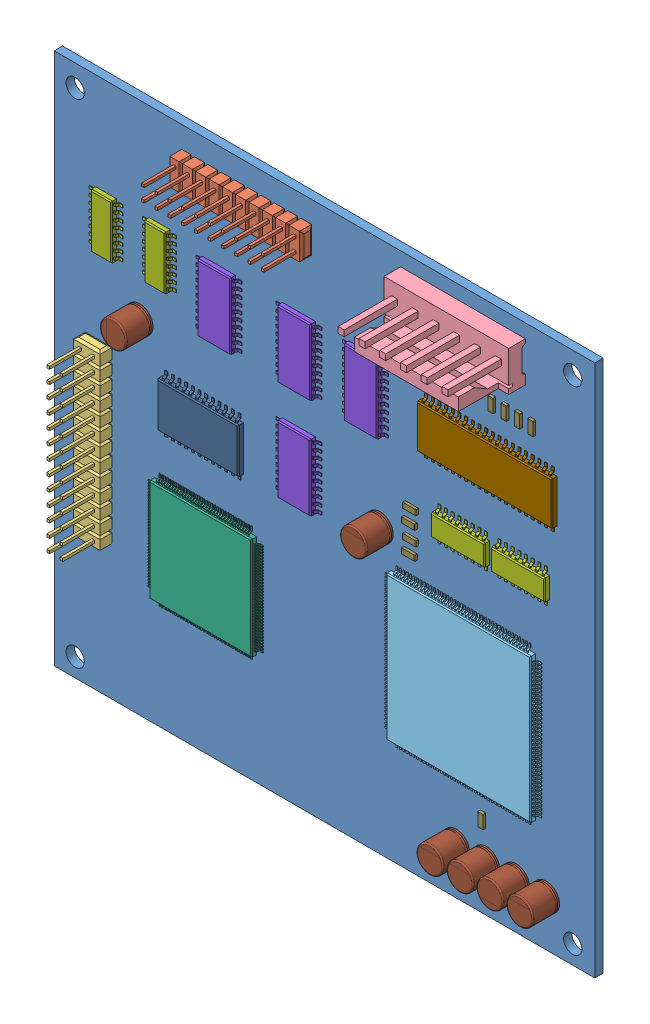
SolidWorks assembly PCB 2.SLDASM, configuration Default (file format 4894). Lengths in mm.
Overall size (103.11 101.6 16.51).
31 component instances, 12 part files, 64 mates.
Components (placement in the parent):
- PCB2-1: PCB2.SLDPRT [Default] at origin size (103.11 101.6 1.6)
- 010897201-1: 010897201.SLDPRT [Default] at (130.7963 94.9293 2.743) x (1 0 0) z (0 -1 0) size (25.4 11.1 5.08)
- 010897261-1: 010897261.SLDPRT [Default] at (102.5733 41.9125 2.743) x (0 1 0) z (1 0 0) size (33.02 11.1 5.08)
- C-0640445-06-3-1: C-0640445-06-3.SLDPRT [Default] at (172.059 95.148 4.775) x (-1 0 0) z (0 0 1) size (23.77 7.62 16.51)
- 160 PIN IC PACKAGE-3: 160 PIN IC PACKAGE.SLDPRT [Default] at (172.1985 33.8975 2.16) x (1 0 0) z (0 -1 0) size (29.9 1.06 29.9)
- 144 PIN IC PACKAGE-4: 144 PIN IC PACKAGE.SLDPRT [Default] at (123.0123 30.7037 2.16) x (1 0 0) z (0 -1 0) size (21.9 1.06 21.9)
- 16 PIN IC PACKAGE-5: 16 PIN IC PACKAGE.SLDPRT [Default] at (114.2542 77.4062 2.16) x (1 0 0) z (0 -1 0) size (6.4 1.06 10.23)
- 16 PIN IC PACKAGE-6: 16 PIN IC PACKAGE.SLDPRT [Default] at (104.0492 77.4062 2.16) x (1 0 0) z (0 -1 0) size (6.4 1.06 10.23)
- 16 PIN IC PACKAGE-7: 16 PIN IC PACKAGE.SLDPRT [Default] at (171.4199 60.231 2.16) x (0 -1 0) z (-1 0 0) size (6.4 1.06 10.23)
- 16 PIN IC PACKAGE-8: 16 PIN IC PACKAGE.SLDPRT [Default] at (182.8729 60.231 2.16) x (0 -1 0) z (-1 0 0) size (6.4 1.06 10.23)
- 20 PIN IC PACKAGE-3: 20 PIN IC PACKAGE.SLDPRT [Default] at (125.5728 74.863 2.16) x (1 0 0) z (0 -1 0) size (8.7 1.06 12.73)
- 20 PIN IC PACKAGE-4: 20 PIN IC PACKAGE.SLDPRT [Default] at (153.5178 76.133 2.16) x (-1 0 0) z (0 1 0) size (8.7 1.06 12.73)
- 20 PIN IC PACKAGE-5: 20 PIN IC PACKAGE.SLDPRT [Default] at (140.8131 55.8084 2.16) x (1 0 0) z (0 -1 0) size (8.7 1.06 12.73)
- 20 PIN IC PACKAGE-6: 20 PIN IC PACKAGE.SLDPRT [Default] at (140.8247 76.133 2.16) x (-1 0 0) z (0 1 0) size (8.7 1.06 12.73)
- 40 PIN IC PACKAGE-2: 40 PIN IC PACKAGE.SLDPRT [Default] at (176.536 75.1992 2.16) x (0 -1 0) z (-1 0 0) size (10.65 1.06 25.73)
- 24 PIN IC PACKAGE-7: 24 PIN IC PACKAGE.SLDPRT [Default] at (123.129 54.0125 2.16) x (0 1 0) z (1 0 0) size (10.9 1.06 15.48)
- CAP-1: CAP.SLDPRT [Default] at (110.3893 65.4238 1.6) x (1 0 0) z (0 -1 0) size (5.08 8.08 5.08)
- CAP-11: CAP.SLDPRT [Default] at (156.2027 53.9923 1.6) x (0 -1 0) z (-1 0 0) size (5.08 8.08 5.08)
- CAP-15: CAP.SLDPRT [Default] at (170.7852 8.8328 1.6) x (0 -1 0) z (-1 0 0) size (5.08 8.08 5.08)
- CAP-16: CAP.SLDPRT [Default] at (176.5151 8.8328 1.6) x (0 -1 0) z (-1 0 0) size (5.08 8.08 5.08)
- CAP-17: CAP.SLDPRT [Default] at (182.211 8.8328 1.6) x (0 1 0) z (1 0 0) size (5.08 8.08 5.08)
- CAP-18: CAP.SLDPRT [Default] at (187.9302 8.8328 1.6) x (0 -1 0) z (-1 0 0) size (5.08 8.08 5.08)
- RES-1: RES.SLDPRT [Default] at (177.7908 85.2573 1.6) x (1 0 0) z (0 -1 0) size (1 0.5 2.54)
- RES-2: RES.SLDPRT [Default] at (180.3077 85.2573 1.6) x (1 0 0) z (0 -1 0) size (1 0.5 2.54)
- RES-3: RES.SLDPRT [Default] at (182.8828 85.2573 1.6) x (1 0 0) z (0 -1 0) size (1 0.5 2.54)
- RES-4: RES.SLDPRT [Default] at (185.4111 85.2573 1.6) x (1 0 0) z (0 -1 0) size (1 0.5 2.54)
- RES-14: RES.SLDPRT [Default] at (175.8821 15.5876 1.6) x (1 0 0) z (0 -1 0) size (1 0.5 2.54)
- RES-22: RES.SLDPRT [Default] at (162.3018 60.2695 1.6) x (0 -1 0) z (-1 0 0) size (1 0.5 2.54)
- RES-23: RES.SLDPRT [Default] at (162.0788 57.731 1.6) x (0 -1 0) z (-1 0 0) size (1 0.5 2.54)
- RES-24: RES.SLDPRT [Default] at (162.3136 55.1258 1.6) x (0 -1 0) z (-1 0 0) size (1 0.5 2.54)
- RES-25: RES.SLDPRT [Default] at (162.1023 52.6293 1.6) x (0 -1 0) z (-1 0 0) size (1 0.5 2.54)
Mates (geometry in assembly coordinates):
- Coincident8: coincident: plane of CAP-18 through (187.9302 6.2928 1.6) normal (0 0 -1); plane of PCB2-1 through (0 101.6 1.6) normal (0 0 1)
- Parallel5: parallel: plane of PCB2-1 through (0 0 1.6) normal (0 -1 0); plane of CAP-18 through (187.6802 7.3128 -1.4) normal (0 -1 0)
- Parallel6: parallel: plane of PCB2-1 through (0 0 1.6) normal (0 -1 0); plane of CAP-17 through (182.461 10.3528 -1.4) normal (0 1 0)
- Coincident11: coincident: plane of CAP-17 through (182.211 11.3728 1.6) normal (0 0 -1); plane of PCB2-1 through (0 101.6 1.6) normal (0 0 1)
- Coincident12: coincident: plane of CAP-16 through (176.5151 6.2928 1.6) normal (0 0 -1); plane of PCB2-1 through (0 101.6 1.6) normal (0 0 1)
- Coincident13: coincident: plane of CAP-17 through (182.461 7.3128 -1.4) normal (0 -1 0); line of CAP-18 through (188.1802 7.3128 -1.4) axis (0 0 1)
- Coincident14: coincident aligned: plane of CAP-16 through (176.2651 7.3128 -1.4) normal (0 -1 0); plane of CAP-17 through (182.461 7.3128 -1.4) normal (0 -1 0)
- Coincident15: coincident aligned: plane of CAP-15 through (170.5352 7.3128 -1.4) normal (0 -1 0); plane of CAP-16 through (176.2651 7.3128 -1.4) normal (0 -1 0)
- Coincident16: coincident: plane of PCB2-1 through (0 101.6 1.6) normal (0 0 1); plane of CAP-15 through (170.7852 6.2928 1.6) normal (0 0 -1)
- Coincident23: coincident: plane of CAP-11 through (156.2027 51.4523 1.6) normal (0 0 -1); plane of PCB2-1 through (0 101.6 1.6) normal (0 0 1)
- Parallel8: parallel: plane of PCB2-1 through (0 101.6 1.6) normal (0 1 0); plane of CAP-11 through (155.9527 55.5123 -1.4) normal (0 1 0)
- Parallel9: parallel: plane of PCB2-1 through (0 101.6 1.6) normal (0 1 0); plane of CAP-1 through (111.4093 65.6738 -1.4) normal (0 1 0)
- Coincident26: coincident: plane of PCB2-1 through (0 101.6 1.6) normal (0 0 1); plane of CAP-1 through (112.9293 65.4238 1.6) normal (0 0 -1)
- Coincident62: coincident: plane of 20 PIN IC PACKAGE-4 through (149.8658 75.113 1.6) normal (0 0 -1); plane of PCB2-1 through (0 101.6 1.6) normal (0 0 1)
- Parallel26: parallel: plane of PCB2-1 through (0 0 1.6) normal (0 -1 0); plane of 20 PIN IC PACKAGE-4 through (156.6699 69.133 2.66) normal (0 -1 0)
- Coincident64: coincident: plane of 20 PIN IC PACKAGE-3 through (129.2249 72.073 1.6) normal (0 0 -1); plane of PCB2-1 through (0 101.6 1.6) normal (0 0 1)
- Coincident65: coincident aligned: plane of 20 PIN IC PACKAGE-3 through (122.4208 69.133 2.66) normal (0 -1 0); plane of 20 PIN IC PACKAGE-4 through (156.6699 69.133 2.66) normal (0 -1 0)
- Coincident66: coincident: plane of 20 PIN IC PACKAGE-6 through (137.1727 75.113 1.6) normal (0 0 -1); plane of PCB2-1 through (0 101.6 1.6) normal (0 0 1)
- Coincident67: coincident aligned: plane of 20 PIN IC PACKAGE-3 through (122.4208 69.133 2.66) normal (0 -1 0); plane of 20 PIN IC PACKAGE-6 through (143.9767 69.133 2.66) normal (0 -1 0)
- Coincident68: coincident: plane of PCB2-1 through (0 101.6 1.6) normal (0 0 1); plane of 16 PIN IC PACKAGE-6 through (106.5492 77.1562 1.6) normal (0 0 -1)
- Parallel27: parallel aligned: plane of 16 PIN IC PACKAGE-6 through (102.0492 72.9262 2.66) normal (0 -1 0); plane of 20 PIN IC PACKAGE-3 through (122.4208 69.133 2.66) normal (0 -1 0)
- Coincident70: coincident: plane of 16 PIN IC PACKAGE-5 through (111.7542 77.1562 1.6) normal (0 0 -1); plane of PCB2-1 through (0 101.6 1.6) normal (0 0 1)
- Coincident71: coincident aligned: plane of 16 PIN IC PACKAGE-5 through (112.2542 72.9262 2.66) normal (0 -1 0); plane of 16 PIN IC PACKAGE-6 through (102.0492 72.9262 2.66) normal (0 -1 0)
- Coincident92: coincident: plane of 144 PIN IC PACKAGE-4 through (112.7623 28.0787 1.6) normal (0 0 -1); plane of PCB2-1 through (0 101.6 1.6) normal (0 0 1)
- Parallel36: parallel: plane of PCB2-1 through (0 0 1.6) normal (0 -1 0); plane of 144 PIN IC PACKAGE-4 through (113.2623 21.2037 2.66) normal (0 -1 0)
- Coincident94: coincident: plane of 24 PIN IC PACKAGE-7 through (115.759 49.2625 1.6) normal (0 0 -1); plane of PCB2-1 through (0 101.6 1.6) normal (0 0 1)
- Parallel37: parallel aligned: plane of 144 PIN IC PACKAGE-4 through (113.2623 21.2037 2.66) normal (0 -1 0); plane of 24 PIN IC PACKAGE-7 through (114.754 49.7625 2.66) normal (0 -1 0)
- Coincident96: coincident: plane of PCB2-1 through (0 101.6 1.6) normal (0 0 1); plane of 20 PIN IC PACKAGE-5 through (137.1611 61.9084 1.6) normal (0 0 -1)
- Parallel38: parallel anti-aligned: plane of 20 PIN IC PACKAGE-5 through (137.6611 62.8084 2.66) normal (0 1 0); plane of 24 PIN IC PACKAGE-7 through (114.754 49.7625 2.66) normal (0 -1 0)
- Coincident98: coincident: plane of PCB2-1 through (0 101.6 1.6) normal (0 0 1); plane of 160 PIN IC PACKAGE-3 through (172.6735 19.9725 1.6) normal (0 0 -1)
- Parallel39: parallel: plane of PCB2-1 through (0 0 1.6) normal (0 -1 0); plane of 160 PIN IC PACKAGE-3 through (158.4485 20.4725 2.66) normal (0 -1 0)
- Coincident100: coincident: plane of PCB2-1 through (0 101.6 1.6) normal (0 0 1); plane of 16 PIN IC PACKAGE-8 through (185.1629 57.731 1.6) normal (0 0 -1)
- Parallel40: parallel: plane of PCB2-1 through (0 0 1.6) normal (0 -1 0); plane of 16 PIN IC PACKAGE-8 through (188.6229 58.231 2.66) normal (0 -1 0)
- Coincident102: coincident: plane of 16 PIN IC PACKAGE-7 through (169.8999 57.731 1.6) normal (0 0 -1); plane of PCB2-1 through (0 101.6 1.6) normal (0 0 1)
- Coincident103: coincident aligned: plane of 16 PIN IC PACKAGE-7 through (177.1699 58.231 2.66) normal (0 -1 0); plane of 16 PIN IC PACKAGE-8 through (188.6229 58.231 2.66) normal (0 -1 0)
- Coincident104: coincident: plane of 40 PIN IC PACKAGE-2 through (177.556 70.5742 1.6) normal (0 0 -1); plane of PCB2-1 through (0 101.6 1.6) normal (0 0 1)
- Parallel41: parallel aligned: plane of 16 PIN IC PACKAGE-7 through (177.1699 58.231 2.66) normal (0 -1 0); plane of 40 PIN IC PACKAGE-2 through (190.036 71.0742 2.66) normal (0 -1 0)
- Coincident145: coincident anti-aligned: plane of PCB2-1 through (0 101.6 1.6) normal (0 0 1); plane of RES-1 through (177.2908 86.5273 1.6) normal (0 0 -1)
- Coincident146: coincident anti-aligned: plane of PCB2-1 through (0 101.6 1.6) normal (0 0 1); plane of RES-2 through (179.8077 86.5273 1.6) normal (0 0 -1)
- Coincident147: coincident anti-aligned: plane of PCB2-1 through (0 101.6 1.6) normal (0 0 1); plane of RES-3 through (182.3828 86.5273 1.6) normal (0 0 -1)
- Coincident148: coincident anti-aligned: plane of PCB2-1 through (0 101.6 1.6) normal (0 0 1); plane of RES-4 through (184.9111 86.5273 1.6) normal (0 0 -1)
- Coincident149: coincident anti-aligned: plane of PCB2-1 through (0 101.6 1.6) normal (0 0 1); plane of RES-24 through (163.5836 55.6258 1.6) normal (0 0 -1)
- Coincident150: coincident anti-aligned: plane of PCB2-1 through (0 101.6 1.6) normal (0 0 1); plane of RES-23 through (163.3488 58.231 1.6) normal (0 0 -1)
- Coincident151: coincident anti-aligned: plane of PCB2-1 through (0 101.6 1.6) normal (0 0 1); plane of RES-22 through (163.5718 60.7695 1.6) normal (0 0 -1)
- Coincident154: coincident anti-aligned: plane of PCB2-1 through (0 101.6 1.6) normal (0 0 1); plane of 010897201-1 through (130.7963 94.9293 1.6) normal (0 0 -1)
- Coincident156: coincident anti-aligned: plane of PCB2-1 through (0 101.6 1.6) normal (0 0 1); plane of 010897261-1 through (102.5733 41.9125 1.6) normal (0 0 -1)
- Coincident164: coincident anti-aligned: plane of PCB2-1 through (0 101.6 1.6) normal (0 0 1); plane of RES-25 through (163.3723 53.1293 1.6) normal (0 0 -1)
- Coincident166: coincident: plane of PCB2-1 through (0 101.6 1.6) normal (0 0 1); plane of RES-14 through (175.3821 16.8576 1.6) normal (0 0 -1)
- Parallel43: parallel aligned: plane of PCB2-1 through (0 0 1.6) normal (0 -1 0); plane of RES-25 through (160.8323 52.1293 2.1) normal (0 -1 0)
- Parallel44: parallel aligned: plane of PCB2-1 through (0 0 1.6) normal (0 -1 0); plane of RES-24 through (161.0436 54.6258 2.1) normal (0 -1 0)
- Parallel45: parallel aligned: plane of PCB2-1 through (0 0 1.6) normal (0 -1 0); plane of RES-23 through (160.8088 57.231 2.1) normal (0 -1 0)
- Parallel46: parallel aligned: plane of PCB2-1 through (0 0 1.6) normal (0 -1 0); plane of RES-22 through (161.0318 59.7695 2.1) normal (0 -1 0)
- Parallel66: parallel aligned: plane of PCB2-1 through (0 0 1.6) normal (0 -1 0); plane of RES-1 through (178.2908 83.9873 2.1) normal (0 -1 0)
- Parallel67: parallel aligned: plane of PCB2-1 through (0 0 1.6) normal (0 -1 0); plane of RES-2 through (180.8077 83.9873 2.1) normal (0 -1 0)
- Parallel68: parallel aligned: plane of PCB2-1 through (0 0 1.6) normal (0 -1 0); plane of RES-3 through (183.3828 83.9873 2.1) normal (0 -1 0)
- Parallel69: parallel aligned: plane of PCB2-1 through (0 0 1.6) normal (0 -1 0); plane of RES-4 through (185.9111 83.9873 2.1) normal (0 -1 0)
- Parallel77: parallel aligned: plane of PCB2-1 through (0 0 1.6) normal (0 -1 0); plane of 010897201-1 through (118.4138 92.3893 1.6) normal (0 -1 0)
- Parallel80: parallel aligned: plane of PCB2-1 through (0 0 1.6) normal (0 -1 0); plane of 010897261-1 through (100.5413 25.4025 1.6) normal (0 -1 0)
- Coincident183: coincident aligned: plane of RES-1 through (178.2908 83.9873 2.1) normal (0 -1 0); plane of RES-2 through (180.8077 83.9873 2.1) normal (0 -1 0)
- Coincident184: coincident aligned: plane of RES-1 through (178.2908 83.9873 2.1) normal (0 -1 0); plane of RES-3 through (183.3828 83.9873 2.1) normal (0 -1 0)
- Coincident185: coincident aligned: plane of RES-1 through (178.2908 83.9873 2.1) normal (0 -1 0); plane of RES-4 through (185.9111 83.9873 2.1) normal (0 -1 0)
- Parallel94: parallel aligned: plane of PCB2-1 through (0 0 1.6) normal (0 -1 0); plane of RES-14 through (176.3821 14.3176 2.1) normal (0 -1 0)
- Coincident197: coincident anti-aligned: plane of PCB2-1 through (0 101.6 1.6) normal (0 0 1); plane of C-0640445-06-3-1 through (183.9462 93.1303 1.6) normal (0 0 -1)
- Parallel95: parallel aligned: plane of PCB2-1 through (0 101.6 1.6) normal (0 1 0); plane of C-0640445-06-3-1 through (183.9462 98.958 4.775) normal (0 1 0)
